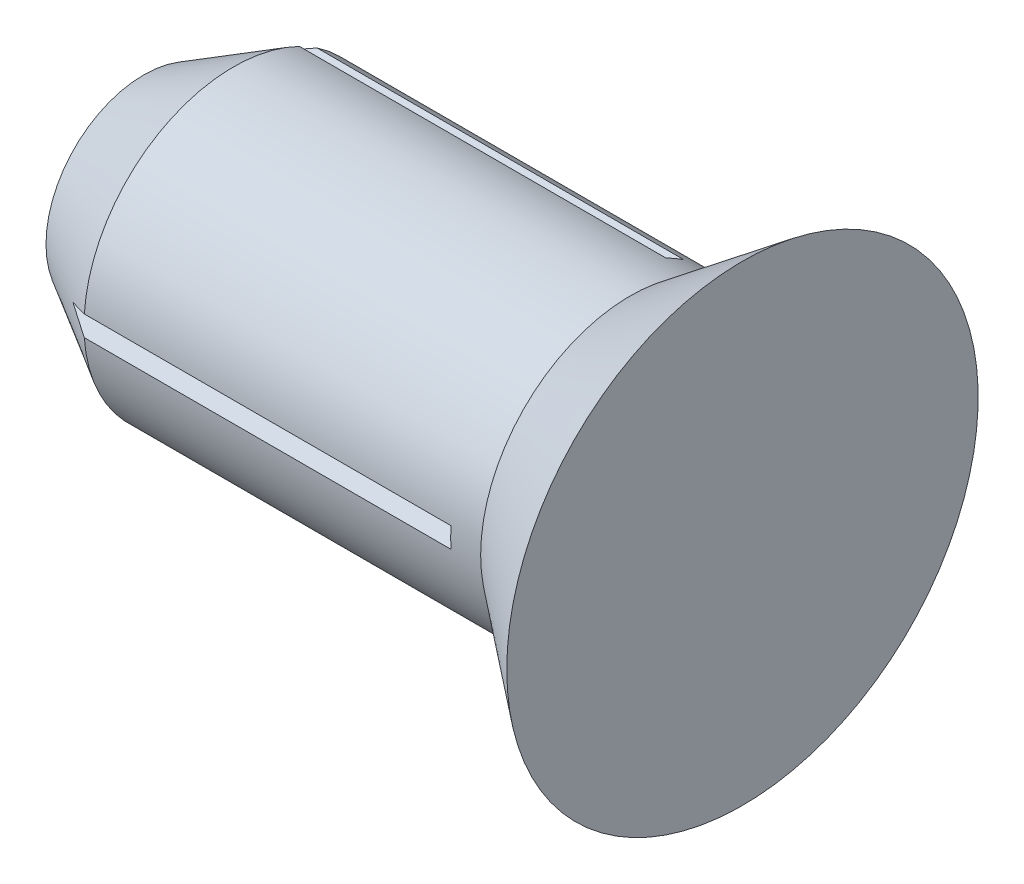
ISO-10303-21;
HEADER;
FILE_DESCRIPTION(('STEP AP214'),'2;1');
FILE_NAME('part.step','',(''),(''),'','','');
FILE_SCHEMA(('AUTOMOTIVE_DESIGN { 1 0 10303 214 1 1 1 1 }'));
ENDSEC;
DATA;
#1=APPLICATION_CONTEXT('core data for automotive mechanical design processes');
#2=APPLICATION_PROTOCOL_DEFINITION('international standard','automotive_design',2000,#1);
#3=PRODUCT_CONTEXT('',#1,'mechanical');
#4=PRODUCT('Part','Part','',(#3));
#5=PRODUCT_RELATED_PRODUCT_CATEGORY('part','',(#4));
#6=PRODUCT_DEFINITION_FORMATION('','',#4);
#7=PRODUCT_DEFINITION_CONTEXT('part definition',#1,'design');
#8=PRODUCT_DEFINITION('design','',#6,#7);
#9=PRODUCT_DEFINITION_SHAPE('','',#8);
#10=(LENGTH_UNIT() NAMED_UNIT(*) SI_UNIT(.MILLI.,.METRE.));
#11=(NAMED_UNIT(*) PLANE_ANGLE_UNIT() SI_UNIT($,.RADIAN.));
#12=(NAMED_UNIT(*) SI_UNIT($,.STERADIAN.) SOLID_ANGLE_UNIT());
#13=UNCERTAINTY_MEASURE_WITH_UNIT(LENGTH_MEASURE(1.E-05),#10,'distance_accuracy_value','');
#14=(GEOMETRIC_REPRESENTATION_CONTEXT(3) GLOBAL_UNCERTAINTY_ASSIGNED_CONTEXT((#13)) GLOBAL_UNIT_ASSIGNED_CONTEXT((#10,
#11,#12)) REPRESENTATION_CONTEXT('',''));
#15=CARTESIAN_POINT('',(0.,0.,0.));
#16=DIRECTION('',(0.,0.,1.));
#17=DIRECTION('',(1.,0.,0.));
#18=AXIS2_PLACEMENT_3D('',#15,#16,#17);
#19=CARTESIAN_POINT('',(7.49354589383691,15.75,0.));
#20=DIRECTION('',(-1.,0.,0.));
#21=DIRECTION('',(0.,0.,1.));
#22=AXIS2_PLACEMENT_3D('',#19,#20,#21);
#23=PLANE('',#22);
#24=CARTESIAN_POINT('',(7.49354589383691,0.,0.));
#25=DIRECTION('',(-1.,0.,0.));
#26=DIRECTION('',(0.,0.,1.));
#27=AXIS2_PLACEMENT_3D('',#24,#25,#26);
#28=CIRCLE('',#27,15.75);
#29=CARTESIAN_POINT('',(7.49354589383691,0.,15.75));
#30=VERTEX_POINT('',#29);
#31=EDGE_CURVE('E161',#30,#30,#28,.T.);
#32=ORIENTED_EDGE('',*,*,#31,.F.);
#33=EDGE_LOOP('',(#32));
#34=FACE_BOUND('',#33,.T.);
#35=ADVANCED_FACE('F33',(#34),#23,.F.);
#36=CARTESIAN_POINT('',(7.49354589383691,0.,0.));
#37=DIRECTION('',(1.,0.,0.));
#38=DIRECTION('',(0.,0.,-1.));
#39=AXIS2_PLACEMENT_3D('',#36,#37,#38);
#40=CONICAL_SURFACE('',#39,15.75,0.654498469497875);
#41=CARTESIAN_POINT('',(0.,0.,0.));
#42=DIRECTION('',(-1.,0.,0.));
#43=DIRECTION('',(0.,0.,1.));
#44=AXIS2_PLACEMENT_3D('',#41,#42,#43);
#45=CIRCLE('',#44,10.);
#46=CARTESIAN_POINT('',(0.,0.,10.));
#47=VERTEX_POINT('',#46);
#48=EDGE_CURVE('E157',#47,#47,#45,.T.);
#49=ORIENTED_EDGE('',*,*,#48,.F.);
#50=EDGE_LOOP('',(#49));
#51=FACE_BOUND('',#50,.T.);
#52=ORIENTED_EDGE('',*,*,#31,.T.);
#53=EDGE_LOOP('',(#52));
#54=FACE_BOUND('',#53,.T.);
#55=ADVANCED_FACE('F207',(#51,#54),#40,.T.);
#56=CARTESIAN_POINT('',(-40.,0.,0.));
#57=DIRECTION('',(-1.,0.,0.));
#58=DIRECTION('',(0.,0.,1.));
#59=AXIS2_PLACEMENT_3D('',#56,#57,#58);
#60=CYLINDRICAL_SURFACE('',#59,10.);
#61=CARTESIAN_POINT('',(-2.00000001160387,0.,0.));
#62=DIRECTION('',(-1.,0.,0.));
#63=DIRECTION('',(0.,0.,1.));
#64=AXIS2_PLACEMENT_3D('',#61,#62,#63);
#65=CIRCLE('',#64,10.);
#66=CARTESIAN_POINT('',(-2.00000001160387,8.98189101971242,-4.39609300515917));
#67=VERTEX_POINT('',#66);
#68=CARTESIAN_POINT('',(-2.00000001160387,8.29807372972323,-5.58049929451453));
#69=VERTEX_POINT('',#68);
#70=EDGE_CURVE('E11',#67,#69,#65,.T.);
#71=ORIENTED_EDGE('',*,*,#70,.F.);
#72=DIRECTION('',(-1.,0.,0.));
#73=VECTOR('',#72,1.);
#74=CARTESIAN_POINT('',(-40.,8.98189101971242,-4.39609300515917));
#75=LINE('',#74,#73);
#76=CARTESIAN_POINT('',(-26.5064541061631,8.98189101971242,-4.39609300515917));
#77=VERTEX_POINT('',#76);
#78=EDGE_CURVE('E119',#67,#77,#75,.T.);
#79=ORIENTED_EDGE('',*,*,#78,.T.);
#80=CARTESIAN_POINT('',(-26.5064541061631,0.,0.));
#81=DIRECTION('',(-1.,0.,0.));
#82=DIRECTION('',(0.,0.,1.));
#83=AXIS2_PLACEMENT_3D('',#80,#81,#82);
#84=CIRCLE('',#83,10.);
#85=CARTESIAN_POINT('',(-26.5064541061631,0.683817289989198,9.97659229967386));
#86=VERTEX_POINT('',#85);
#87=EDGE_CURVE('E154',#86,#77,#84,.T.);
#88=ORIENTED_EDGE('',*,*,#87,.F.);
#89=DIRECTION('',(-1.,0.,0.));
#90=VECTOR('',#89,1.);
#91=CARTESIAN_POINT('',(-40.,0.683817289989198,9.97659229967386));
#92=LINE('',#91,#90);
#93=CARTESIAN_POINT('',(-2.00000001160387,0.683817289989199,9.97659229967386));
#94=VERTEX_POINT('',#93);
#95=EDGE_CURVE('E144',#86,#94,#92,.F.);
#96=ORIENTED_EDGE('',*,*,#95,.T.);
#97=CARTESIAN_POINT('',(-2.00000001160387,0.,0.));
#98=DIRECTION('',(-1.,0.,0.));
#99=DIRECTION('',(0.,0.,1.));
#100=AXIS2_PLACEMENT_3D('',#97,#98,#99);
#101=CIRCLE('',#100,10.);
#102=CARTESIAN_POINT('',(-2.00000001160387,-0.683817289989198,9.97659229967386));
#103=VERTEX_POINT('',#102);
#104=EDGE_CURVE('E235',#103,#94,#101,.T.);
#105=ORIENTED_EDGE('',*,*,#104,.F.);
#106=DIRECTION('',(-1.,0.,0.));
#107=VECTOR('',#106,1.);
#108=CARTESIAN_POINT('',(-40.,-0.683817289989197,9.97659229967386));
#109=LINE('',#108,#107);
#110=CARTESIAN_POINT('',(-26.5064541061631,-0.683817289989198,9.97659229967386));
#111=VERTEX_POINT('',#110);
#112=EDGE_CURVE('E147',#103,#111,#109,.T.);
#113=ORIENTED_EDGE('',*,*,#112,.T.);
#114=CARTESIAN_POINT('',(-26.5064541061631,-8.98189101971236,-4.3960930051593));
#115=VERTEX_POINT('',#114);
#116=EDGE_CURVE('E153',#115,#111,#84,.T.);
#117=ORIENTED_EDGE('',*,*,#116,.F.);
#118=DIRECTION('',(-1.,0.,0.));
#119=VECTOR('',#118,1.);
#120=CARTESIAN_POINT('',(-40.,-8.98189101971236,-4.3960930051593));
#121=LINE('',#120,#119);
#122=CARTESIAN_POINT('',(-2.00000001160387,-8.98189101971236,-4.3960930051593));
#123=VERTEX_POINT('',#122);
#124=EDGE_CURVE('E55',#115,#123,#121,.F.);
#125=ORIENTED_EDGE('',*,*,#124,.T.);
#126=CARTESIAN_POINT('',(-2.00000001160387,0.,0.));
#127=DIRECTION('',(-1.,0.,0.));
#128=DIRECTION('',(0.,0.,1.));
#129=AXIS2_PLACEMENT_3D('',#126,#127,#128);
#130=CIRCLE('',#129,10.);
#131=CARTESIAN_POINT('',(-2.00000001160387,-8.29807372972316,-5.58049929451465));
#132=VERTEX_POINT('',#131);
#133=EDGE_CURVE('E266',#132,#123,#130,.T.);
#134=ORIENTED_EDGE('',*,*,#133,.F.);
#135=DIRECTION('',(-1.,0.,0.));
#136=VECTOR('',#135,1.);
#137=CARTESIAN_POINT('',(-40.,-8.29807372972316,-5.58049929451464));
#138=LINE('',#137,#136);
#139=CARTESIAN_POINT('',(-26.5064541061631,-8.29807372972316,-5.58049929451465));
#140=VERTEX_POINT('',#139);
#141=EDGE_CURVE('E133',#132,#140,#138,.T.);
#142=ORIENTED_EDGE('',*,*,#141,.T.);
#143=CARTESIAN_POINT('',(-26.5064541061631,8.29807372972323,-5.58049929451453));
#144=VERTEX_POINT('',#143);
#145=EDGE_CURVE('E158',#144,#140,#84,.T.);
#146=ORIENTED_EDGE('',*,*,#145,.F.);
#147=DIRECTION('',(-1.,0.,0.));
#148=VECTOR('',#147,1.);
#149=CARTESIAN_POINT('',(-40.,8.29807372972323,-5.58049929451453));
#150=LINE('',#149,#148);
#151=EDGE_CURVE('E47',#144,#69,#150,.F.);
#152=ORIENTED_EDGE('',*,*,#151,.T.);
#153=EDGE_LOOP('',(#71,#79,#88,#96,#105,#113,#117,#125,#134,#142,#146,#152));
#154=FACE_BOUND('',#153,.T.);
#155=ORIENTED_EDGE('',*,*,#48,.T.);
#156=EDGE_LOOP('',(#155));
#157=FACE_BOUND('',#156,.T.);
#158=ADVANCED_FACE('F204',(#154,#157),#60,.T.);
#159=CARTESIAN_POINT('',(-26.5064541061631,0.,0.));
#160=DIRECTION('',(1.,0.,0.));
#161=DIRECTION('',(0.,0.,-1.));
#162=AXIS2_PLACEMENT_3D('',#159,#160,#161);
#163=CONICAL_SURFACE('',#162,10.,0.523598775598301);
#164=CARTESIAN_POINT('',(-32.5064541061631,0.,0.));
#165=DIRECTION('',(-1.,0.,0.));
#166=DIRECTION('',(0.,0.,1.));
#167=AXIS2_PLACEMENT_3D('',#164,#165,#166);
#168=CIRCLE('',#167,6.53589838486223);
#169=CARTESIAN_POINT('',(-32.5064541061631,0.,6.53589838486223));
#170=VERTEX_POINT('',#169);
#171=EDGE_CURVE('E150',#170,#170,#168,.T.);
#172=ORIENTED_EDGE('',*,*,#171,.F.);
#173=EDGE_LOOP('',(#172));
#174=FACE_BOUND('',#173,.T.);
#175=ORIENTED_EDGE('',*,*,#87,.T.);
#176=CARTESIAN_POINT('',(-26.5062541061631,8.98202532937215,-4.39608125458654));
#177=CARTESIAN_POINT('',(-26.6515926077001,8.88442165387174,-4.40462046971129));
#178=CARTESIAN_POINT('',(-26.7967256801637,8.78651373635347,-4.41318630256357));
#179=CARTESIAN_POINT('',(-27.0865272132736,8.59002629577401,-4.4303767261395));
#180=CARTESIAN_POINT('',(-27.2311956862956,8.49144679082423,-4.43900131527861));
#181=CARTESIAN_POINT('',(-27.5200226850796,8.29354740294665,-4.45631526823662));
#182=CARTESIAN_POINT('',(-27.6641812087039,8.19422751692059,-4.46500463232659));
#183=CARTESIAN_POINT('',(-27.951929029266,7.99476476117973,-4.48245536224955));
#184=CARTESIAN_POINT('',(-28.0955183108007,7.89462186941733,-4.49121673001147));
#185=CARTESIAN_POINT('',(-28.2387897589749,7.79402863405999,-4.50001749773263));
#186=B_SPLINE_CURVE_WITH_KNOTS('',3,(#176,#177,#178,#179,#180,#181,#182,#183,#184,#185),
.UNSPECIFIED.,.F.,.F.,(4,2,2,2,4),(0.,0.525836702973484,1.05165928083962,1.57748406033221,
2.10332297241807),.UNSPECIFIED.);
#187=CARTESIAN_POINT('',(-28.238504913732,7.79422863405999,-4.49999999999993));
#188=VERTEX_POINT('',#187);
#189=EDGE_CURVE('E40',#77,#188,#186,.T.);
#190=ORIENTED_EDGE('',*,*,#189,.T.);
#191=CARTESIAN_POINT('',(-28.2388180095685,7.79413537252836,-4.49979999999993));
#192=CARTESIAN_POINT('',(-28.0955442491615,7.8368110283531,-4.59131823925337));
#193=CARTESIAN_POINT('',(-27.9519526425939,7.87929562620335,-4.68242675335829));
#194=CARTESIAN_POINT('',(-27.6642001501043,7.96391565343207,-4.86389498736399));
#195=CARTESIAN_POINT('',(-27.5200392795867,8.00605109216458,-4.95425472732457));
#196=CARTESIAN_POINT('',(-27.2312075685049,8.09000786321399,-5.13430060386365));
#197=CARTESIAN_POINT('',(-27.0865367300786,8.13182919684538,-5.2239867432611));
#198=CARTESIAN_POINT('',(-26.7967304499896,8.21518695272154,-5.40274802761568));
#199=CARTESIAN_POINT('',(-26.6515949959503,8.25672336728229,-5.49182315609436));
#200=CARTESIAN_POINT('',(-26.5062541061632,8.29813070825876,-5.58062148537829));
#201=B_SPLINE_CURVE_WITH_KNOTS('',3,(#191,#192,#193,#194,#195,#196,#197,#198,#199,#200),
.UNSPECIFIED.,.F.,.F.,(4,2,2,2,4),(0.,0.525847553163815,1.05168097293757,1.57751219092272,
2.10335753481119),.UNSPECIFIED.);
#202=EDGE_CURVE('E112',#188,#144,#201,.T.);
#203=ORIENTED_EDGE('',*,*,#202,.T.);
#204=ORIENTED_EDGE('',*,*,#145,.T.);
#205=CARTESIAN_POINT('',(-26.5062541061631,-8.29813070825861,-5.58062148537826));
#206=CARTESIAN_POINT('',(-26.6515949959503,-8.25672336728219,-5.49182315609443));
#207=CARTESIAN_POINT('',(-26.7967304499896,-8.21518695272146,-5.40274802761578));
#208=CARTESIAN_POINT('',(-27.0865367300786,-8.13182919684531,-5.22398674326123));
#209=CARTESIAN_POINT('',(-27.2312075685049,-8.09000786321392,-5.13430060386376));
#210=CARTESIAN_POINT('',(-27.5200392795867,-8.00605109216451,-4.95425472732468));
#211=CARTESIAN_POINT('',(-27.6642001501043,-7.963915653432,-4.8638949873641));
#212=CARTESIAN_POINT('',(-27.9519526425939,-7.87929562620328,-4.6824267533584));
#213=CARTESIAN_POINT('',(-28.0955442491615,-7.83681102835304,-4.59131823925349));
#214=CARTESIAN_POINT('',(-28.2388180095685,-7.7941353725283,-4.49980000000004));
#215=B_SPLINE_CURVE_WITH_KNOTS('',3,(#205,#206,#207,#208,#209,#210,#211,#212,#213,#214),
.UNSPECIFIED.,.F.,.F.,(4,2,2,2,4),(0.,0.525845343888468,1.05167656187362,1.57750998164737,
2.10335753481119),.UNSPECIFIED.);
#216=CARTESIAN_POINT('',(-28.238504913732,-7.79422863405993,-4.50000000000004));
#217=VERTEX_POINT('',#216);
#218=EDGE_CURVE('E238',#140,#217,#215,.T.);
#219=ORIENTED_EDGE('',*,*,#218,.T.);
#220=CARTESIAN_POINT('',(-28.2387897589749,-7.79402863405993,-4.50001749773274));
#221=CARTESIAN_POINT('',(-28.0955183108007,-7.89462186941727,-4.49121673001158));
#222=CARTESIAN_POINT('',(-27.951929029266,-7.99476476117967,-4.48245536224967));
#223=CARTESIAN_POINT('',(-27.6641812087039,-8.19422751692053,-4.4650046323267));
#224=CARTESIAN_POINT('',(-27.5200226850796,-8.29354740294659,-4.45631526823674));
#225=CARTESIAN_POINT('',(-27.2311956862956,-8.49144679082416,-4.43900131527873));
#226=CARTESIAN_POINT('',(-27.0865272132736,-8.59002629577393,-4.43037672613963));
#227=CARTESIAN_POINT('',(-26.7967256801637,-8.78651373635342,-4.4131863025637));
#228=CARTESIAN_POINT('',(-26.6515926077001,-8.88442165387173,-4.40462046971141));
#229=CARTESIAN_POINT('',(-26.5062541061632,-8.98202532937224,-4.39608125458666));
#230=B_SPLINE_CURVE_WITH_KNOTS('',3,(#220,#221,#222,#223,#224,#225,#226,#227,#228,#229),
.UNSPECIFIED.,.F.,.F.,(4,2,2,2,4),(0.,0.525838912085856,1.05166369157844,1.57748626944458,
2.10332297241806),.UNSPECIFIED.);
#231=EDGE_CURVE('E232',#217,#115,#230,.T.);
#232=ORIENTED_EDGE('',*,*,#231,.T.);
#233=ORIENTED_EDGE('',*,*,#116,.T.);
#234=CARTESIAN_POINT('',(-26.5062541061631,-0.683894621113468,9.97670273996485));
#235=CARTESIAN_POINT('',(-26.6515978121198,-0.627695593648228,9.89644221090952));
#236=CARTESIAN_POINT('',(-26.7967360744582,-0.57132138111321,9.81593149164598));
#237=CARTESIAN_POINT('',(-27.0865479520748,-0.458186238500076,9.65435776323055));
#238=CARTESIAN_POINT('',(-27.2312215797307,-0.401425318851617,9.57329476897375));
#239=CARTESIAN_POINT('',(-27.5200588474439,-0.287477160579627,9.41055993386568));
#240=CARTESIAN_POINT('',(-27.6642224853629,-0.230289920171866,9.32888809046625));
#241=CARTESIAN_POINT('',(-27.9519804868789,-0.1154415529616,9.16486762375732));
#242=CARTESIAN_POINT('',(-28.0955748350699,-0.0577804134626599,9.08251898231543));
#243=CARTESIAN_POINT('',(-28.2388513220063,0.000140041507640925,8.9998));
#244=B_SPLINE_CURVE_WITH_KNOTS('',3,(#234,#235,#236,#237,#238,#239,#240,#241,#242,#243),
.UNSPECIFIED.,.F.,.F.,(4,2,2,2,4),(0.,0.525855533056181,1.05169693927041,1.57754054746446,
2.10339828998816),.UNSPECIFIED.);
#245=CARTESIAN_POINT('',(-28.238504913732,0.,9.));
#246=VERTEX_POINT('',#245);
#247=EDGE_CURVE('E173',#111,#246,#244,.T.);
#248=ORIENTED_EDGE('',*,*,#247,.T.);
#249=CARTESIAN_POINT('',(-28.2388513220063,-0.000140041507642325,8.9998));
#250=CARTESIAN_POINT('',(-28.0955748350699,0.0577804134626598,9.08251898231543));
#251=CARTESIAN_POINT('',(-27.9519804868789,0.115441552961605,9.16486762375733));
#252=CARTESIAN_POINT('',(-27.6642224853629,0.230289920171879,9.32888809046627));
#253=CARTESIAN_POINT('',(-27.5200588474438,0.287477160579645,9.4105599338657));
#254=CARTESIAN_POINT('',(-27.2312215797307,0.401425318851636,9.57329476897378));
#255=CARTESIAN_POINT('',(-27.0865479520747,0.458186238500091,9.65435776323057));
#256=CARTESIAN_POINT('',(-26.7967360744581,0.571321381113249,9.81593149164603));
#257=CARTESIAN_POINT('',(-26.6515978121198,0.627695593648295,9.89644221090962));
#258=CARTESIAN_POINT('',(-26.5062541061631,0.683894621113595,9.97670273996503));
#259=B_SPLINE_CURVE_WITH_KNOTS('',3,(#249,#250,#251,#252,#253,#254,#255,#256,#257,#258),
.UNSPECIFIED.,.F.,.F.,(4,2,2,2,4),(0.,0.525857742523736,1.05170135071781,1.57754275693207,
2.10339828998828),.UNSPECIFIED.);
#260=EDGE_CURVE('E164',#246,#86,#259,.T.);
#261=ORIENTED_EDGE('',*,*,#260,.T.);
#262=EDGE_LOOP('',(#175,#190,#203,#204,#219,#232,#233,#248,#261));
#263=FACE_BOUND('',#262,.T.);
#264=ADVANCED_FACE('F180',(#174,#263),#163,.T.);
#265=CARTESIAN_POINT('',(-32.5064541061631,0.,0.));
#266=DIRECTION('',(1.,0.,0.));
#267=DIRECTION('',(0.,0.,-1.));
#268=AXIS2_PLACEMENT_3D('',#265,#266,#267);
#269=PLANE('',#268);
#270=ORIENTED_EDGE('',*,*,#171,.T.);
#271=EDGE_LOOP('',(#270));
#272=FACE_BOUND('',#271,.T.);
#273=ADVANCED_FACE('F196',(#272),#269,.F.);
#274=CARTESIAN_POINT('',(-2.00000001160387,0.,9.));
#275=DIRECTION('',(-1.,0.,0.));
#276=DIRECTION('',(0.,0.,1.));
#277=AXIS2_PLACEMENT_3D('',#274,#275,#276);
#278=PLANE('',#277);
#279=ORIENTED_EDGE('',*,*,#104,.T.);
#280=DIRECTION('',(0.,-0.573576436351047,-0.819152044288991));
#281=VECTOR('',#280,1.);
#282=CARTESIAN_POINT('',(-2.00000001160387,0.,9.));
#283=LINE('',#282,#281);
#284=CARTESIAN_POINT('',(-2.00000001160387,0.,9.));
#285=VERTEX_POINT('',#284);
#286=EDGE_CURVE('E139',#94,#285,#283,.T.);
#287=ORIENTED_EDGE('',*,*,#286,.T.);
#288=DIRECTION('',(0.,-0.573576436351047,0.819152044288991));
#289=VECTOR('',#288,1.);
#290=CARTESIAN_POINT('',(-2.00000001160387,0.,9.));
#291=LINE('',#290,#289);
#292=EDGE_CURVE('E136',#285,#103,#291,.T.);
#293=ORIENTED_EDGE('',*,*,#292,.T.);
#294=EDGE_LOOP('',(#279,#287,#293));
#295=FACE_BOUND('',#294,.T.);
#296=ADVANCED_FACE('F191',(#295),#278,.T.);
#297=CARTESIAN_POINT('',(-2.00000001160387,0.,9.));
#298=DIRECTION('',(0.,-0.819152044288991,-0.573576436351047));
#299=DIRECTION('',(0.,0.573576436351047,-0.819152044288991));
#300=AXIS2_PLACEMENT_3D('',#297,#298,#299);
#301=PLANE('',#300);
#302=ORIENTED_EDGE('',*,*,#292,.F.);
#303=DIRECTION('',(-1.,0.,0.));
#304=VECTOR('',#303,1.);
#305=CARTESIAN_POINT('',(-2.00000001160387,0.,9.));
#306=LINE('',#305,#304);
#307=EDGE_CURVE('E141',#285,#246,#306,.T.);
#308=ORIENTED_EDGE('',*,*,#307,.T.);
#309=ORIENTED_EDGE('',*,*,#247,.F.);
#310=ORIENTED_EDGE('',*,*,#112,.F.);
#311=EDGE_LOOP('',(#302,#308,#309,#310));
#312=FACE_BOUND('',#311,.T.);
#313=ADVANCED_FACE('F189',(#312),#301,.F.);
#314=CARTESIAN_POINT('',(-2.00000001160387,0.,9.));
#315=DIRECTION('',(0.,0.819152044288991,-0.573576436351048));
#316=DIRECTION('',(0.,0.573576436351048,0.819152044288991));
#317=AXIS2_PLACEMENT_3D('',#314,#315,#316);
#318=PLANE('',#317);
#319=ORIENTED_EDGE('',*,*,#260,.F.);
#320=ORIENTED_EDGE('',*,*,#307,.F.);
#321=ORIENTED_EDGE('',*,*,#286,.F.);
#322=ORIENTED_EDGE('',*,*,#95,.F.);
#323=EDGE_LOOP('',(#319,#320,#321,#322));
#324=FACE_BOUND('',#323,.T.);
#325=ADVANCED_FACE('F184',(#324),#318,.F.);
#326=CARTESIAN_POINT('',(-2.00000001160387,-7.79422863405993,-4.50000000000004));
#327=DIRECTION('',(-1.,0.,0.));
#328=DIRECTION('',(0.,-0.866025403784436,-0.500000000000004));
#329=AXIS2_PLACEMENT_3D('',#326,#327,#328);
#330=PLANE('',#329);
#331=DIRECTION('',(0.,-0.422618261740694,-0.906307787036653));
#332=VECTOR('',#331,1.);
#333=CARTESIAN_POINT('',(-2.00000001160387,-7.79422863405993,-4.50000000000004));
#334=LINE('',#333,#332);
#335=CARTESIAN_POINT('',(-2.00000001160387,-7.79422863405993,-4.50000000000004));
#336=VERTEX_POINT('',#335);
#337=EDGE_CURVE('E124',#336,#132,#334,.T.);
#338=ORIENTED_EDGE('',*,*,#337,.T.);
#339=ORIENTED_EDGE('',*,*,#133,.T.);
#340=DIRECTION('',(0.,0.996194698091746,-0.0871557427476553));
#341=VECTOR('',#340,1.);
#342=CARTESIAN_POINT('',(-2.00000001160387,-7.79422863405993,-4.50000000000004));
#343=LINE('',#342,#341);
#344=EDGE_CURVE('E127',#123,#336,#343,.T.);
#345=ORIENTED_EDGE('',*,*,#344,.T.);
#346=EDGE_LOOP('',(#338,#339,#345));
#347=FACE_BOUND('',#346,.T.);
#348=ADVANCED_FACE('F188',(#347),#330,.T.);
#349=CARTESIAN_POINT('',(-2.00000001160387,-7.79422863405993,-4.50000000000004));
#350=DIRECTION('',(0.,0.906307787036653,-0.422618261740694));
#351=DIRECTION('',(0.,0.422618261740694,0.906307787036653));
#352=AXIS2_PLACEMENT_3D('',#349,#350,#351);
#353=PLANE('',#352);
#354=ORIENTED_EDGE('',*,*,#337,.F.);
#355=DIRECTION('',(-1.,0.,0.));
#356=VECTOR('',#355,1.);
#357=CARTESIAN_POINT('',(-2.00000001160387,-7.79422863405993,-4.50000000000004));
#358=LINE('',#357,#356);
#359=EDGE_CURVE('E129',#336,#217,#358,.T.);
#360=ORIENTED_EDGE('',*,*,#359,.T.);
#361=ORIENTED_EDGE('',*,*,#218,.F.);
#362=ORIENTED_EDGE('',*,*,#141,.F.);
#363=EDGE_LOOP('',(#354,#360,#361,#362));
#364=FACE_BOUND('',#363,.T.);
#365=ADVANCED_FACE('F255',(#364),#353,.F.);
#366=CARTESIAN_POINT('',(-2.00000001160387,-7.79422863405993,-4.50000000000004));
#367=DIRECTION('',(0.,0.0871557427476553,0.996194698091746));
#368=DIRECTION('',(0.,-0.996194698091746,0.0871557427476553));
#369=AXIS2_PLACEMENT_3D('',#366,#367,#368);
#370=PLANE('',#369);
#371=ORIENTED_EDGE('',*,*,#231,.F.);
#372=ORIENTED_EDGE('',*,*,#359,.F.);
#373=ORIENTED_EDGE('',*,*,#344,.F.);
#374=ORIENTED_EDGE('',*,*,#124,.F.);
#375=EDGE_LOOP('',(#371,#372,#373,#374));
#376=FACE_BOUND('',#375,.T.);
#377=ADVANCED_FACE('F251',(#376),#370,.F.);
#378=CARTESIAN_POINT('',(-2.00000001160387,7.79422863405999,-4.49999999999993));
#379=DIRECTION('',(-1.,0.,0.));
#380=DIRECTION('',(0.,0.866025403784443,-0.499999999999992));
#381=AXIS2_PLACEMENT_3D('',#378,#379,#380);
#382=PLANE('',#381);
#383=DIRECTION('',(0.,0.996194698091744,0.0871557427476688));
#384=VECTOR('',#383,1.);
#385=CARTESIAN_POINT('',(-2.00000001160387,7.79422863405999,-4.49999999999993));
#386=LINE('',#385,#384);
#387=CARTESIAN_POINT('',(-2.00000001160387,7.79422863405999,-4.49999999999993));
#388=VERTEX_POINT('',#387);
#389=EDGE_CURVE('E107',#388,#67,#386,.T.);
#390=ORIENTED_EDGE('',*,*,#389,.T.);
#391=ORIENTED_EDGE('',*,*,#70,.T.);
#392=DIRECTION('',(0.,-0.422618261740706,0.906307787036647));
#393=VECTOR('',#392,1.);
#394=CARTESIAN_POINT('',(-2.00000001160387,7.79422863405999,-4.49999999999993));
#395=LINE('',#394,#393);
#396=EDGE_CURVE('E103',#69,#388,#395,.T.);
#397=ORIENTED_EDGE('',*,*,#396,.T.);
#398=EDGE_LOOP('',(#390,#391,#397));
#399=FACE_BOUND('',#398,.T.);
#400=ADVANCED_FACE('F105',(#399),#382,.T.);
#401=CARTESIAN_POINT('',(-2.00000001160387,7.79422863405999,-4.49999999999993));
#402=DIRECTION('',(0.,-0.0871557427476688,0.996194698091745));
#403=DIRECTION('',(0.,-0.996194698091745,-0.0871557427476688));
#404=AXIS2_PLACEMENT_3D('',#401,#402,#403);
#405=PLANE('',#404);
#406=ORIENTED_EDGE('',*,*,#389,.F.);
#407=DIRECTION('',(-1.,0.,0.));
#408=VECTOR('',#407,1.);
#409=CARTESIAN_POINT('',(-2.00000001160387,7.79422863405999,-4.49999999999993));
#410=LINE('',#409,#408);
#411=EDGE_CURVE('E108',#388,#188,#410,.T.);
#412=ORIENTED_EDGE('',*,*,#411,.T.);
#413=ORIENTED_EDGE('',*,*,#189,.F.);
#414=ORIENTED_EDGE('',*,*,#78,.F.);
#415=EDGE_LOOP('',(#406,#412,#413,#414));
#416=FACE_BOUND('',#415,.T.);
#417=ADVANCED_FACE('F117',(#416),#405,.F.);
#418=CARTESIAN_POINT('',(-2.00000001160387,7.79422863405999,-4.49999999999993));
#419=DIRECTION('',(0.,-0.906307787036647,-0.422618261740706));
#420=DIRECTION('',(0.,0.422618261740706,-0.906307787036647));
#421=AXIS2_PLACEMENT_3D('',#418,#419,#420);
#422=PLANE('',#421);
#423=ORIENTED_EDGE('',*,*,#202,.F.);
#424=ORIENTED_EDGE('',*,*,#411,.F.);
#425=ORIENTED_EDGE('',*,*,#396,.F.);
#426=ORIENTED_EDGE('',*,*,#151,.F.);
#427=EDGE_LOOP('',(#423,#424,#425,#426));
#428=FACE_BOUND('',#427,.T.);
#429=ADVANCED_FACE('F111',(#428),#422,.F.);
#430=CLOSED_SHELL('',(#35,#55,#158,#264,#273,#296,#313,#325,#348,#365,#377,#400,#417,#429));
#431=MANIFOLD_SOLID_BREP('B2',#430);
#432=ADVANCED_BREP_SHAPE_REPRESENTATION('',(#18,#431),#14);
#433=SHAPE_DEFINITION_REPRESENTATION(#9,#432);
ENDSEC;
END-ISO-10303-21;
